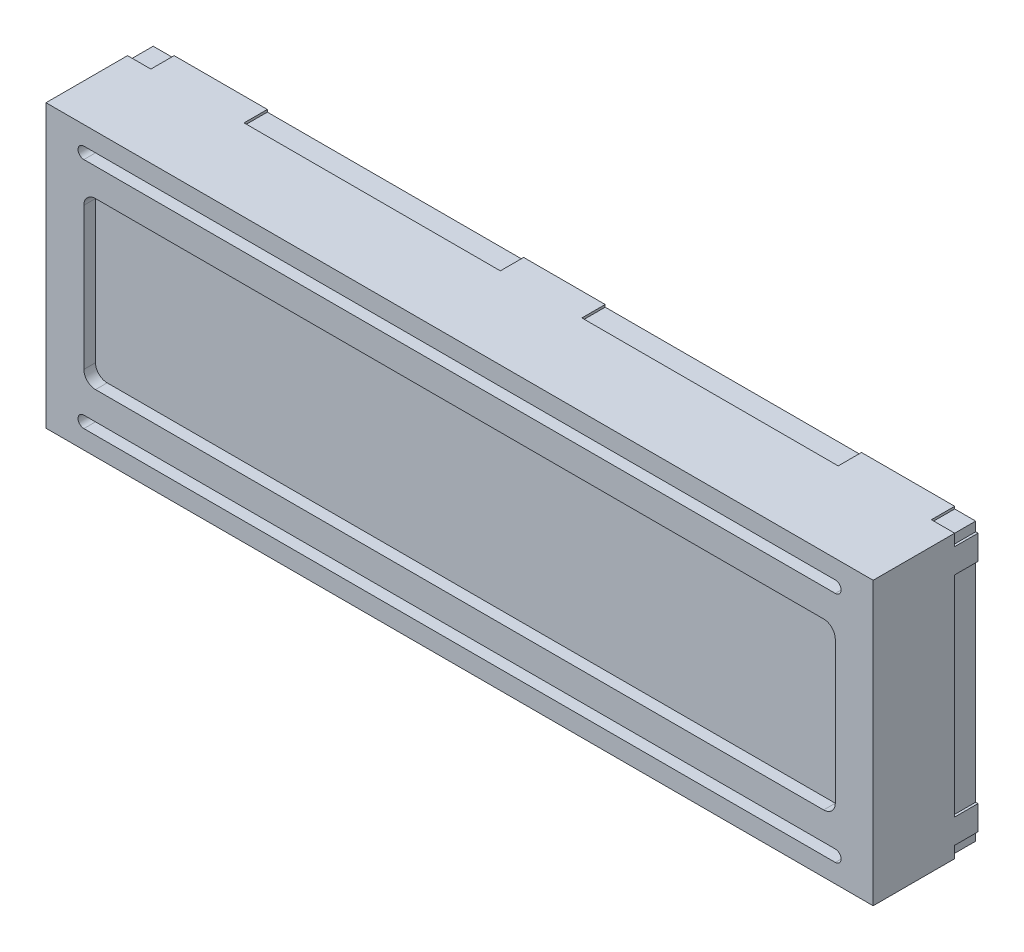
from build123d import *

# Parameters (mm, degrees)
ESQUISSE1_W             = 71
ESQUISSE1_H             = 24.2
BOSS_EXTRU_1_DEPTH      = 9
ENL_V_MAT_EXTRU_1_DEPTH = 1
ENL_V_MAT_EXTRU_2_DEPTH = 1
ESQUISSE4_W             = 22
ESQUISSE4_H             = 4
ESQUISSE4_W_2           = 4
ENL_V_MAT_EXTRU_3_DEPTH = 0.2
ESQUISSE5_W             = 4
ESQUISSE5_H             = 1
ESQUISSE5_H_2           = 18
ENL_V_MAT_EXTRU_4_DEPTH = 0.2


with BuildPart() as part:
    # Esquisse1 → Boss.-Extru.1 (new body)
    with BuildSketch(Plane.XY):
        Rectangle(ESQUISSE1_W, ESQUISSE1_H)
    extrude(amount=BOSS_EXTRU_1_DEPTH)

    # Esquisse2 → Enl_v. mat.-Extru.1 (cut)
    with BuildSketch(Plane.XY.offset(9)):
        with BuildLine():
            Line((-31.25, 7.1), (31.25, 7.1))
            ThreePointArc((31.25, 7.1), (31.957106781, 6.807106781), (32.25, 6.1))
            Line((32.25, 6.1), (32.25, -6.1))
            ThreePointArc((32.25, -6.1), (31.957106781, -6.807106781), (31.25, -7.1))
            Line((31.25, -7.1), (-31.25, -7.1))
            ThreePointArc((-31.25, -7.1), (-31.957106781, -6.807106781), (-32.25, -6.1))
            Line((-32.25, -6.1), (-32.25, 6.1))
            ThreePointArc((-32.25, 6.1), (-31.957106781, 6.807106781), (-31.25, 7.1))
        make_face()
    extrude(amount=-ENL_V_MAT_EXTRU_1_DEPTH, mode=Mode.SUBTRACT)

    # Esquisse3 → Enl_v. mat.-Extru.2 (cut)
    with BuildSketch(Plane.XY.offset(9)):
        with BuildLine():
            Line((-32.25, 10.5), (32.25, 10.5))
            ThreePointArc((32.25, 10.5), (32.75, 10), (32.25, 9.5))
            Line((32.25, 9.5), (-32.25, 9.5))
            ThreePointArc((-32.25, 9.5), (-32.75, 10), (-32.25, 10.5))
        make_face()
        with BuildLine():
            Line((-32.25, -10.5), (32.25, -10.5))
            ThreePointArc((32.25, -10.5), (32.75, -10), (32.25, -9.5))
            Line((32.25, -9.5), (-32.25, -9.5))
            ThreePointArc((-32.25, -9.5), (-32.75, -10), (-32.25, -10.5))
        make_face()
    extrude(amount=-ENL_V_MAT_EXTRU_2_DEPTH, mode=Mode.SUBTRACT)

    # Esquisse4 → Enl_v. mat.-Extru.3 (cut)
    with BuildSketch(Plane.XZ.offset(12.1)):
        with Locations((14.5, 0)):
            Rectangle(ESQUISSE4_W, ESQUISSE4_H)
        with Locations((-14.5, 0)):
            Rectangle(ESQUISSE4_W, ESQUISSE4_H)
        with Locations((35.5, 0)):
            Rectangle(ESQUISSE4_W_2, ESQUISSE4_H)
        with Locations((-35.5, 0)):
            Rectangle(ESQUISSE4_W_2, ESQUISSE4_H)
    enl_v_mat_extru_3 = extrude(amount=-ENL_V_MAT_EXTRU_3_DEPTH, mode=Mode.SUBTRACT)

    # Sym_trie1: Enl_v. mat.-Extru.3 across plane
    add(enl_v_mat_extru_3.mirror(Plane.ZX), mode=Mode.SUBTRACT)

    # Esquisse5 → Enl_v. mat.-Extru.4 (cut)
    with BuildSketch(Plane(origin=(35.5, 0, 0), x_dir=(0, 0, -1), z_dir=(1, 0, 0))):
        with Locations((0, 11.6)):
            Rectangle(ESQUISSE5_W, ESQUISSE5_H)
        Rectangle(ESQUISSE5_W, ESQUISSE5_H_2)
        with Locations((0, -11.6)):
            Rectangle(ESQUISSE5_W, ESQUISSE5_H)
    enl_v_mat_extru_4 = extrude(amount=-ENL_V_MAT_EXTRU_4_DEPTH, mode=Mode.SUBTRACT)

    # Sym_trie2: Enl_v. mat.-Extru.4 across plane
    add(enl_v_mat_extru_4.mirror(Plane(origin=(0, 0, 0), x_dir=(0, 0, 1), z_dir=(1, 0, 0))), mode=Mode.SUBTRACT)


solid = part.part
